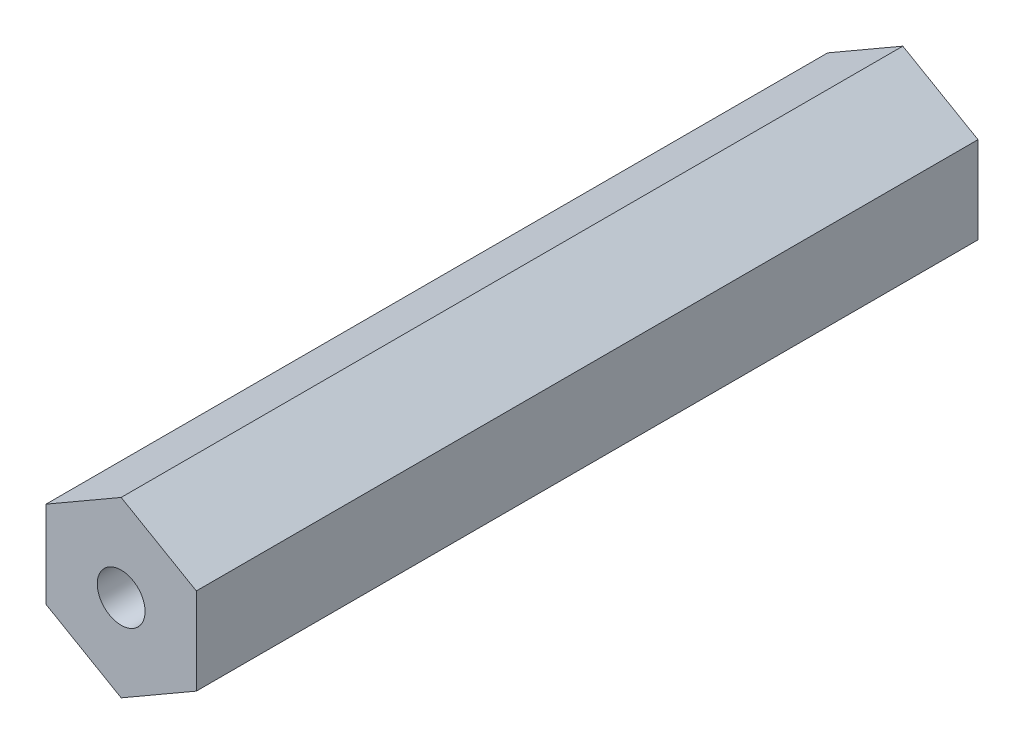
ISO-10303-21;
HEADER;
FILE_DESCRIPTION(('STEP AP214'),'2;1');
FILE_NAME('part.step','',(''),(''),'','','');
FILE_SCHEMA(('AUTOMOTIVE_DESIGN { 1 0 10303 214 1 1 1 1 }'));
ENDSEC;
DATA;
#1=APPLICATION_CONTEXT('core data for automotive mechanical design processes');
#2=APPLICATION_PROTOCOL_DEFINITION('international standard','automotive_design',2000,#1);
#3=PRODUCT_CONTEXT('',#1,'mechanical');
#4=PRODUCT('Part','Part','',(#3));
#5=PRODUCT_RELATED_PRODUCT_CATEGORY('part','',(#4));
#6=PRODUCT_DEFINITION_FORMATION('','',#4);
#7=PRODUCT_DEFINITION_CONTEXT('part definition',#1,'design');
#8=PRODUCT_DEFINITION('design','',#6,#7);
#9=PRODUCT_DEFINITION_SHAPE('','',#8);
#10=(LENGTH_UNIT() NAMED_UNIT(*) SI_UNIT(.MILLI.,.METRE.));
#11=(NAMED_UNIT(*) PLANE_ANGLE_UNIT() SI_UNIT($,.RADIAN.));
#12=(NAMED_UNIT(*) SI_UNIT($,.STERADIAN.) SOLID_ANGLE_UNIT());
#13=UNCERTAINTY_MEASURE_WITH_UNIT(LENGTH_MEASURE(1.E-05),#10,'distance_accuracy_value','');
#14=(GEOMETRIC_REPRESENTATION_CONTEXT(3) GLOBAL_UNCERTAINTY_ASSIGNED_CONTEXT((#13)) GLOBAL_UNIT_ASSIGNED_CONTEXT((#10,
#11,#12)) REPRESENTATION_CONTEXT('',''));
#15=CARTESIAN_POINT('',(0.,0.,0.));
#16=DIRECTION('',(0.,0.,1.));
#17=DIRECTION('',(1.,0.,0.));
#18=AXIS2_PLACEMENT_3D('',#15,#16,#17);
#19=CARTESIAN_POINT('',(6.35,3.66617420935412,66.04));
#20=DIRECTION('',(-0.5,-0.866025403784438,0.));
#21=DIRECTION('',(0.866025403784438,-0.5,0.));
#22=AXIS2_PLACEMENT_3D('',#19,#20,#21);
#23=PLANE('',#22);
#24=DIRECTION('',(-0.866025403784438,0.5,0.));
#25=VECTOR('',#24,1.);
#26=CARTESIAN_POINT('',(6.35,3.66617420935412,0.));
#27=LINE('',#26,#25);
#28=CARTESIAN_POINT('',(6.35,3.66617420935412,0.));
#29=VERTEX_POINT('',#28);
#30=CARTESIAN_POINT('',(0.,7.33234841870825,0.));
#31=VERTEX_POINT('',#30);
#32=EDGE_CURVE('E119',#29,#31,#27,.T.);
#33=ORIENTED_EDGE('',*,*,#32,.T.);
#34=DIRECTION('',(0.,0.,-1.));
#35=VECTOR('',#34,1.);
#36=CARTESIAN_POINT('',(0.,7.33234841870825,66.04));
#37=LINE('',#36,#35);
#38=CARTESIAN_POINT('',(0.,7.33234841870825,66.04));
#39=VERTEX_POINT('',#38);
#40=EDGE_CURVE('E11',#39,#31,#37,.T.);
#41=ORIENTED_EDGE('',*,*,#40,.F.);
#42=DIRECTION('',(-0.866025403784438,0.5,0.));
#43=VECTOR('',#42,1.);
#44=CARTESIAN_POINT('',(6.35,3.66617420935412,66.04));
#45=LINE('',#44,#43);
#46=CARTESIAN_POINT('',(6.35,3.66617420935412,66.04));
#47=VERTEX_POINT('',#46);
#48=EDGE_CURVE('E130',#47,#39,#45,.T.);
#49=ORIENTED_EDGE('',*,*,#48,.F.);
#50=DIRECTION('',(0.,0.,-1.));
#51=VECTOR('',#50,1.);
#52=CARTESIAN_POINT('',(6.35,3.66617420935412,66.04));
#53=LINE('',#52,#51);
#54=EDGE_CURVE('E115',#47,#29,#53,.T.);
#55=ORIENTED_EDGE('',*,*,#54,.T.);
#56=EDGE_LOOP('',(#33,#41,#49,#55));
#57=FACE_BOUND('',#56,.T.);
#58=ADVANCED_FACE('F32',(#57),#23,.F.);
#59=CARTESIAN_POINT('',(0.,7.33234841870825,66.04));
#60=DIRECTION('',(0.5,-0.866025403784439,0.));
#61=DIRECTION('',(0.866025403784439,0.5,0.));
#62=AXIS2_PLACEMENT_3D('',#59,#60,#61);
#63=PLANE('',#62);
#64=DIRECTION('',(-0.866025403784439,-0.5,0.));
#65=VECTOR('',#64,1.);
#66=CARTESIAN_POINT('',(0.,7.33234841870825,0.));
#67=LINE('',#66,#65);
#68=CARTESIAN_POINT('',(-6.35,3.66617420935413,0.));
#69=VERTEX_POINT('',#68);
#70=EDGE_CURVE('E122',#31,#69,#67,.T.);
#71=ORIENTED_EDGE('',*,*,#70,.T.);
#72=DIRECTION('',(0.,0.,-1.));
#73=VECTOR('',#72,1.);
#74=CARTESIAN_POINT('',(-6.35,3.66617420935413,66.04));
#75=LINE('',#74,#73);
#76=CARTESIAN_POINT('',(-6.35,3.66617420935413,66.04));
#77=VERTEX_POINT('',#76);
#78=EDGE_CURVE('E40',#77,#69,#75,.T.);
#79=ORIENTED_EDGE('',*,*,#78,.F.);
#80=DIRECTION('',(-0.866025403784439,-0.5,0.));
#81=VECTOR('',#80,1.);
#82=CARTESIAN_POINT('',(0.,7.33234841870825,66.04));
#83=LINE('',#82,#81);
#84=EDGE_CURVE('E86',#39,#77,#83,.T.);
#85=ORIENTED_EDGE('',*,*,#84,.F.);
#86=ORIENTED_EDGE('',*,*,#40,.T.);
#87=EDGE_LOOP('',(#71,#79,#85,#86));
#88=FACE_BOUND('',#87,.T.);
#89=ADVANCED_FACE('F155',(#88),#63,.F.);
#90=CARTESIAN_POINT('',(-6.35,3.66617420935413,66.04));
#91=DIRECTION('',(1.,0.,0.));
#92=DIRECTION('',(0.,1.,0.));
#93=AXIS2_PLACEMENT_3D('',#90,#91,#92);
#94=PLANE('',#93);
#95=DIRECTION('',(0.,-1.,0.));
#96=VECTOR('',#95,1.);
#97=CARTESIAN_POINT('',(-6.35,3.66617420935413,0.));
#98=LINE('',#97,#96);
#99=CARTESIAN_POINT('',(-6.35,-3.66617420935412,0.));
#100=VERTEX_POINT('',#99);
#101=EDGE_CURVE('E125',#69,#100,#98,.T.);
#102=ORIENTED_EDGE('',*,*,#101,.T.);
#103=DIRECTION('',(0.,0.,-1.));
#104=VECTOR('',#103,1.);
#105=CARTESIAN_POINT('',(-6.35,-3.66617420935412,66.04));
#106=LINE('',#105,#104);
#107=CARTESIAN_POINT('',(-6.35,-3.66617420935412,66.04));
#108=VERTEX_POINT('',#107);
#109=EDGE_CURVE('E110',#108,#100,#106,.T.);
#110=ORIENTED_EDGE('',*,*,#109,.F.);
#111=DIRECTION('',(0.,-1.,0.));
#112=VECTOR('',#111,1.);
#113=CARTESIAN_POINT('',(-6.35,3.66617420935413,66.04));
#114=LINE('',#113,#112);
#115=EDGE_CURVE('E101',#77,#108,#114,.T.);
#116=ORIENTED_EDGE('',*,*,#115,.F.);
#117=ORIENTED_EDGE('',*,*,#78,.T.);
#118=EDGE_LOOP('',(#102,#110,#116,#117));
#119=FACE_BOUND('',#118,.T.);
#120=ADVANCED_FACE('F136',(#119),#94,.F.);
#121=CARTESIAN_POINT('',(-6.35,-3.66617420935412,66.04));
#122=DIRECTION('',(0.5,0.866025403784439,0.));
#123=DIRECTION('',(-0.866025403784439,0.5,0.));
#124=AXIS2_PLACEMENT_3D('',#121,#122,#123);
#125=PLANE('',#124);
#126=DIRECTION('',(0.866025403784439,-0.5,0.));
#127=VECTOR('',#126,1.);
#128=CARTESIAN_POINT('',(-6.35,-3.66617420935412,0.));
#129=LINE('',#128,#127);
#130=CARTESIAN_POINT('',(0.,-7.33234841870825,0.));
#131=VERTEX_POINT('',#130);
#132=EDGE_CURVE('E109',#100,#131,#129,.T.);
#133=ORIENTED_EDGE('',*,*,#132,.T.);
#134=DIRECTION('',(0.,0.,-1.));
#135=VECTOR('',#134,1.);
#136=CARTESIAN_POINT('',(0.,-7.33234841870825,66.04));
#137=LINE('',#136,#135);
#138=CARTESIAN_POINT('',(0.,-7.33234841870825,66.04));
#139=VERTEX_POINT('',#138);
#140=EDGE_CURVE('E106',#139,#131,#137,.T.);
#141=ORIENTED_EDGE('',*,*,#140,.F.);
#142=DIRECTION('',(0.866025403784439,-0.5,0.));
#143=VECTOR('',#142,1.);
#144=CARTESIAN_POINT('',(-6.35,-3.66617420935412,66.04));
#145=LINE('',#144,#143);
#146=EDGE_CURVE('E95',#108,#139,#145,.T.);
#147=ORIENTED_EDGE('',*,*,#146,.F.);
#148=ORIENTED_EDGE('',*,*,#109,.T.);
#149=EDGE_LOOP('',(#133,#141,#147,#148));
#150=FACE_BOUND('',#149,.T.);
#151=ADVANCED_FACE('F107',(#150),#125,.F.);
#152=CARTESIAN_POINT('',(0.,-7.33234841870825,66.04));
#153=DIRECTION('',(-0.5,0.866025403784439,0.));
#154=DIRECTION('',(-0.866025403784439,-0.5,0.));
#155=AXIS2_PLACEMENT_3D('',#152,#153,#154);
#156=PLANE('',#155);
#157=DIRECTION('',(0.866025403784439,0.5,0.));
#158=VECTOR('',#157,1.);
#159=CARTESIAN_POINT('',(0.,-7.33234841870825,0.));
#160=LINE('',#159,#158);
#161=CARTESIAN_POINT('',(6.35,-3.66617420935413,0.));
#162=VERTEX_POINT('',#161);
#163=EDGE_CURVE('E72',#131,#162,#160,.T.);
#164=ORIENTED_EDGE('',*,*,#163,.T.);
#165=DIRECTION('',(0.,0.,-1.));
#166=VECTOR('',#165,1.);
#167=CARTESIAN_POINT('',(6.35,-3.66617420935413,66.04));
#168=LINE('',#167,#166);
#169=CARTESIAN_POINT('',(6.35,-3.66617420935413,66.04));
#170=VERTEX_POINT('',#169);
#171=EDGE_CURVE('E111',#170,#162,#168,.T.);
#172=ORIENTED_EDGE('',*,*,#171,.F.);
#173=DIRECTION('',(0.866025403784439,0.5,0.));
#174=VECTOR('',#173,1.);
#175=CARTESIAN_POINT('',(0.,-7.33234841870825,66.04));
#176=LINE('',#175,#174);
#177=EDGE_CURVE('E99',#139,#170,#176,.T.);
#178=ORIENTED_EDGE('',*,*,#177,.F.);
#179=ORIENTED_EDGE('',*,*,#140,.T.);
#180=EDGE_LOOP('',(#164,#172,#178,#179));
#181=FACE_BOUND('',#180,.T.);
#182=ADVANCED_FACE('F113',(#181),#156,.F.);
#183=CARTESIAN_POINT('',(6.35,-3.66617420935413,66.04));
#184=DIRECTION('',(-1.,0.,0.));
#185=DIRECTION('',(0.,-1.,0.));
#186=AXIS2_PLACEMENT_3D('',#183,#184,#185);
#187=PLANE('',#186);
#188=DIRECTION('',(0.,1.,0.));
#189=VECTOR('',#188,1.);
#190=CARTESIAN_POINT('',(6.35,-3.66617420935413,0.));
#191=LINE('',#190,#189);
#192=EDGE_CURVE('E78',#162,#29,#191,.T.);
#193=ORIENTED_EDGE('',*,*,#192,.T.);
#194=ORIENTED_EDGE('',*,*,#54,.F.);
#195=DIRECTION('',(0.,1.,0.));
#196=VECTOR('',#195,1.);
#197=CARTESIAN_POINT('',(6.35,-3.66617420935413,66.04));
#198=LINE('',#197,#196);
#199=EDGE_CURVE('E48',#170,#47,#198,.T.);
#200=ORIENTED_EDGE('',*,*,#199,.F.);
#201=ORIENTED_EDGE('',*,*,#171,.T.);
#202=EDGE_LOOP('',(#193,#194,#200,#201));
#203=FACE_BOUND('',#202,.T.);
#204=ADVANCED_FACE('F143',(#203),#187,.F.);
#205=CARTESIAN_POINT('',(0.,0.,66.04));
#206=DIRECTION('',(0.,0.,1.));
#207=DIRECTION('',(1.,0.,0.));
#208=AXIS2_PLACEMENT_3D('',#205,#206,#207);
#209=PLANE('',#208);
#210=CARTESIAN_POINT('',(0.,0.,66.04));
#211=DIRECTION('',(0.,0.,1.));
#212=DIRECTION('',(1.,0.,0.));
#213=AXIS2_PLACEMENT_3D('',#210,#211,#212);
#214=CIRCLE('',#213,2.01929999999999);
#215=CARTESIAN_POINT('',(2.01929999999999,0.,66.04));
#216=VERTEX_POINT('',#215);
#217=EDGE_CURVE('E241',#216,#216,#214,.T.);
#218=ORIENTED_EDGE('',*,*,#217,.F.);
#219=EDGE_LOOP('',(#218));
#220=FACE_BOUND('',#219,.T.);
#221=ORIENTED_EDGE('',*,*,#48,.T.);
#222=ORIENTED_EDGE('',*,*,#84,.T.);
#223=ORIENTED_EDGE('',*,*,#115,.T.);
#224=ORIENTED_EDGE('',*,*,#146,.T.);
#225=ORIENTED_EDGE('',*,*,#177,.T.);
#226=ORIENTED_EDGE('',*,*,#199,.T.);
#227=EDGE_LOOP('',(#221,#222,#223,#224,#225,#226));
#228=FACE_BOUND('',#227,.T.);
#229=ADVANCED_FACE('F97',(#220,#228),#209,.T.);
#230=CARTESIAN_POINT('',(0.,0.,0.));
#231=DIRECTION('',(0.,0.,1.));
#232=DIRECTION('',(1.,0.,0.));
#233=AXIS2_PLACEMENT_3D('',#230,#231,#232);
#234=PLANE('',#233);
#235=CARTESIAN_POINT('',(0.,0.,0.));
#236=DIRECTION('',(0.,0.,-1.));
#237=DIRECTION('',(-1.,0.,0.));
#238=AXIS2_PLACEMENT_3D('',#235,#236,#237);
#239=CIRCLE('',#238,2.01929999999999);
#240=CARTESIAN_POINT('',(-2.01929999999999,0.,0.));
#241=VERTEX_POINT('',#240);
#242=EDGE_CURVE('E243',#241,#241,#239,.T.);
#243=ORIENTED_EDGE('',*,*,#242,.F.);
#244=EDGE_LOOP('',(#243));
#245=FACE_BOUND('',#244,.T.);
#246=ORIENTED_EDGE('',*,*,#32,.F.);
#247=ORIENTED_EDGE('',*,*,#192,.F.);
#248=ORIENTED_EDGE('',*,*,#163,.F.);
#249=ORIENTED_EDGE('',*,*,#132,.F.);
#250=ORIENTED_EDGE('',*,*,#101,.F.);
#251=ORIENTED_EDGE('',*,*,#70,.F.);
#252=EDGE_LOOP('',(#246,#247,#248,#249,#250,#251));
#253=FACE_BOUND('',#252,.T.);
#254=ADVANCED_FACE('F139',(#245,#253),#234,.F.);
#255=CARTESIAN_POINT('',(0.,0.,12.7));
#256=DIRECTION('',(0.,0.,-1.));
#257=DIRECTION('',(-1.,0.,0.));
#258=AXIS2_PLACEMENT_3D('',#255,#256,#257);
#259=CONICAL_SURFACE('',#258,2.01929999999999,1.02974425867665);
#260=CARTESIAN_POINT('',(0.,0.,13.9133178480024));
#261=VERTEX_POINT('',#260);
#262=VERTEX_LOOP('',#261);
#263=FACE_BOUND('',#262,.T.);
#264=CARTESIAN_POINT('',(0.,0.,12.7));
#265=DIRECTION('',(0.,0.,-1.));
#266=DIRECTION('',(-1.,0.,0.));
#267=AXIS2_PLACEMENT_3D('',#264,#265,#266);
#268=CIRCLE('',#267,2.01929999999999);
#269=CARTESIAN_POINT('',(-2.01929999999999,0.,12.7));
#270=VERTEX_POINT('',#269);
#271=EDGE_CURVE('E123',#270,#270,#268,.T.);
#272=ORIENTED_EDGE('',*,*,#271,.T.);
#273=EDGE_LOOP('',(#272));
#274=FACE_BOUND('',#273,.T.);
#275=ADVANCED_FACE('F187',(#263,#274),#259,.F.);
#276=CARTESIAN_POINT('',(0.,0.,0.));
#277=DIRECTION('',(0.,0.,-1.));
#278=DIRECTION('',(-1.,0.,0.));
#279=AXIS2_PLACEMENT_3D('',#276,#277,#278);
#280=CYLINDRICAL_SURFACE('',#279,2.01929999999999);
#281=ORIENTED_EDGE('',*,*,#271,.F.);
#282=EDGE_LOOP('',(#281));
#283=FACE_BOUND('',#282,.T.);
#284=ORIENTED_EDGE('',*,*,#242,.T.);
#285=EDGE_LOOP('',(#284));
#286=FACE_BOUND('',#285,.T.);
#287=ADVANCED_FACE('F196',(#283,#286),#280,.F.);
#288=CARTESIAN_POINT('',(0.,0.,53.34));
#289=DIRECTION('',(0.,0.,1.));
#290=DIRECTION('',(1.,0.,0.));
#291=AXIS2_PLACEMENT_3D('',#288,#289,#290);
#292=CONICAL_SURFACE('',#291,2.01929999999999,1.02974425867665);
#293=CARTESIAN_POINT('',(0.,0.,52.1266821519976));
#294=VERTEX_POINT('',#293);
#295=VERTEX_LOOP('',#294);
#296=FACE_BOUND('',#295,.T.);
#297=CARTESIAN_POINT('',(0.,0.,53.34));
#298=DIRECTION('',(0.,0.,1.));
#299=DIRECTION('',(1.,0.,0.));
#300=AXIS2_PLACEMENT_3D('',#297,#298,#299);
#301=CIRCLE('',#300,2.01929999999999);
#302=CARTESIAN_POINT('',(2.01929999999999,0.,53.34));
#303=VERTEX_POINT('',#302);
#304=EDGE_CURVE('E238',#303,#303,#301,.T.);
#305=ORIENTED_EDGE('',*,*,#304,.T.);
#306=EDGE_LOOP('',(#305));
#307=FACE_BOUND('',#306,.T.);
#308=ADVANCED_FACE('F206',(#296,#307),#292,.F.);
#309=CARTESIAN_POINT('',(0.,0.,66.04));
#310=DIRECTION('',(0.,0.,1.));
#311=DIRECTION('',(1.,0.,0.));
#312=AXIS2_PLACEMENT_3D('',#309,#310,#311);
#313=CYLINDRICAL_SURFACE('',#312,2.01929999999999);
#314=ORIENTED_EDGE('',*,*,#304,.F.);
#315=EDGE_LOOP('',(#314));
#316=FACE_BOUND('',#315,.T.);
#317=ORIENTED_EDGE('',*,*,#217,.T.);
#318=EDGE_LOOP('',(#317));
#319=FACE_BOUND('',#318,.T.);
#320=ADVANCED_FACE('F221',(#316,#319),#313,.F.);
#321=CLOSED_SHELL('',(#58,#89,#120,#151,#182,#204,#229,#254,#275,#287,#308,#320));
#322=MANIFOLD_SOLID_BREP('B2',#321);
#323=ADVANCED_BREP_SHAPE_REPRESENTATION('',(#18,#322),#14);
#324=SHAPE_DEFINITION_REPRESENTATION(#9,#323);
ENDSEC;
END-ISO-10303-21;
